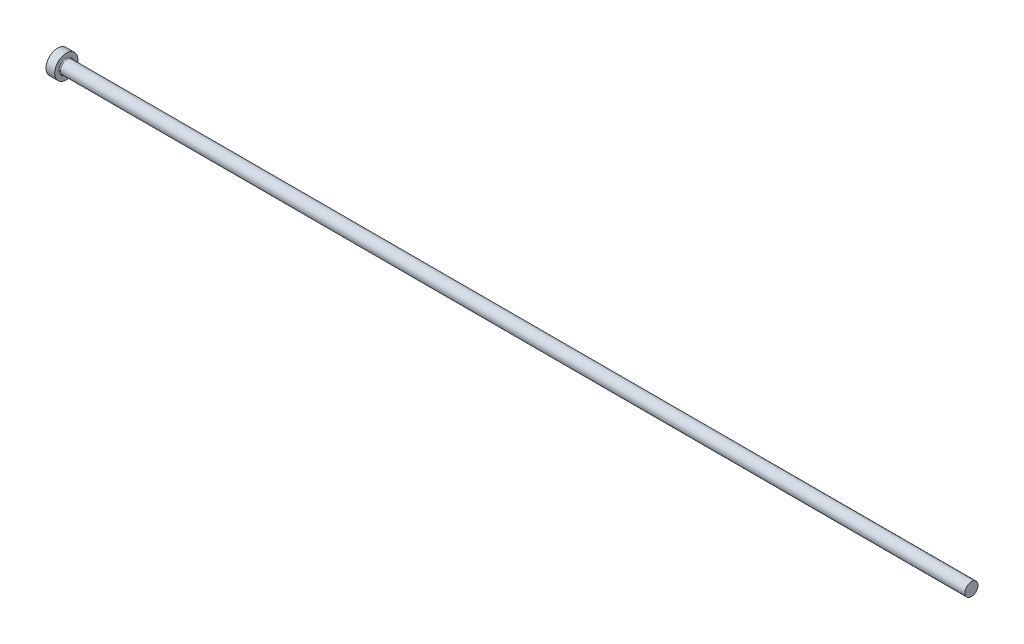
ISO-10303-21;
HEADER;
FILE_DESCRIPTION(('STEP AP214'),'2;1');
FILE_NAME('part.step','',(''),(''),'','','');
FILE_SCHEMA(('AUTOMOTIVE_DESIGN { 1 0 10303 214 1 1 1 1 }'));
ENDSEC;
DATA;
#1=APPLICATION_CONTEXT('core data for automotive mechanical design processes');
#2=APPLICATION_PROTOCOL_DEFINITION('international standard','automotive_design',2000,#1);
#3=PRODUCT_CONTEXT('',#1,'mechanical');
#4=PRODUCT('Part','Part','',(#3));
#5=PRODUCT_RELATED_PRODUCT_CATEGORY('part','',(#4));
#6=PRODUCT_DEFINITION_FORMATION('','',#4);
#7=PRODUCT_DEFINITION_CONTEXT('part definition',#1,'design');
#8=PRODUCT_DEFINITION('design','',#6,#7);
#9=PRODUCT_DEFINITION_SHAPE('','',#8);
#10=(LENGTH_UNIT() NAMED_UNIT(*) SI_UNIT(.MILLI.,.METRE.));
#11=(NAMED_UNIT(*) PLANE_ANGLE_UNIT() SI_UNIT($,.RADIAN.));
#12=(NAMED_UNIT(*) SI_UNIT($,.STERADIAN.) SOLID_ANGLE_UNIT());
#13=UNCERTAINTY_MEASURE_WITH_UNIT(LENGTH_MEASURE(1.E-05),#10,'distance_accuracy_value','');
#14=(GEOMETRIC_REPRESENTATION_CONTEXT(3) GLOBAL_UNCERTAINTY_ASSIGNED_CONTEXT((#13)) GLOBAL_UNIT_ASSIGNED_CONTEXT((#10,
#11,#12)) REPRESENTATION_CONTEXT('',''));
#15=CARTESIAN_POINT('',(0.,0.,0.));
#16=DIRECTION('',(0.,0.,1.));
#17=DIRECTION('',(1.,0.,0.));
#18=AXIS2_PLACEMENT_3D('',#15,#16,#17);
#19=CARTESIAN_POINT('',(0.,0.,0.));
#20=DIRECTION('',(-1.,0.,0.));
#21=DIRECTION('',(0.,-1.,0.));
#22=AXIS2_PLACEMENT_3D('',#19,#20,#21);
#23=PLANE('',#22);
#24=CARTESIAN_POINT('',(0.,0.,0.));
#25=DIRECTION('',(1.,0.,0.));
#26=DIRECTION('',(0.,1.,0.));
#27=AXIS2_PLACEMENT_3D('',#24,#25,#26);
#28=CIRCLE('',#27,4.);
#29=CARTESIAN_POINT('',(0.,4.,0.));
#30=VERTEX_POINT('',#29);
#31=EDGE_CURVE('E25',#30,#30,#28,.T.);
#32=ORIENTED_EDGE('',*,*,#31,.F.);
#33=EDGE_LOOP('',(#32));
#34=FACE_BOUND('',#33,.T.);
#35=ADVANCED_FACE('F14',(#34),#23,.T.);
#36=CARTESIAN_POINT('',(315.,0.,0.));
#37=DIRECTION('',(1.,0.,0.));
#38=DIRECTION('',(0.,1.,0.));
#39=AXIS2_PLACEMENT_3D('',#36,#37,#38);
#40=CYLINDRICAL_SURFACE('',#39,4.);
#41=ORIENTED_EDGE('',*,*,#31,.T.);
#42=EDGE_LOOP('',(#41));
#43=FACE_BOUND('',#42,.T.);
#44=CARTESIAN_POINT('',(3.,0.,0.));
#45=DIRECTION('',(1.,0.,0.));
#46=DIRECTION('',(0.,1.,0.));
#47=AXIS2_PLACEMENT_3D('',#44,#45,#46);
#48=CIRCLE('',#47,4.);
#49=CARTESIAN_POINT('',(3.,4.,0.));
#50=VERTEX_POINT('',#49);
#51=EDGE_CURVE('E29',#50,#50,#48,.T.);
#52=ORIENTED_EDGE('',*,*,#51,.F.);
#53=EDGE_LOOP('',(#52));
#54=FACE_BOUND('',#53,.T.);
#55=ADVANCED_FACE('F51',(#43,#54),#40,.T.);
#56=CARTESIAN_POINT('',(3.,4.,0.));
#57=DIRECTION('',(1.,0.,0.));
#58=DIRECTION('',(0.,1.,0.));
#59=AXIS2_PLACEMENT_3D('',#56,#57,#58);
#60=PLANE('',#59);
#61=CARTESIAN_POINT('',(3.,0.,0.));
#62=DIRECTION('',(1.,0.,0.));
#63=DIRECTION('',(0.,1.,0.));
#64=AXIS2_PLACEMENT_3D('',#61,#62,#63);
#65=CIRCLE('',#64,2.54999999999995);
#66=CARTESIAN_POINT('',(3.,2.54999999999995,0.));
#67=VERTEX_POINT('',#66);
#68=EDGE_CURVE('E9',#67,#67,#65,.F.);
#69=ORIENTED_EDGE('',*,*,#68,.T.);
#70=EDGE_LOOP('',(#69));
#71=FACE_BOUND('',#70,.T.);
#72=ORIENTED_EDGE('',*,*,#51,.T.);
#73=EDGE_LOOP('',(#72));
#74=FACE_BOUND('',#73,.T.);
#75=ADVANCED_FACE('F42',(#71,#74),#60,.T.);
#76=CARTESIAN_POINT('',(315.,0.,0.));
#77=DIRECTION('',(1.,0.,0.));
#78=DIRECTION('',(0.,1.,0.));
#79=AXIS2_PLACEMENT_3D('',#76,#77,#78);
#80=CYLINDRICAL_SURFACE('',#79,2.24999999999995);
#81=CARTESIAN_POINT('',(3.3,0.,0.));
#82=DIRECTION('',(1.,0.,0.));
#83=DIRECTION('',(0.,1.,0.));
#84=AXIS2_PLACEMENT_3D('',#81,#82,#83);
#85=CIRCLE('',#84,2.24999999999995);
#86=CARTESIAN_POINT('',(3.3,2.24999999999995,0.));
#87=VERTEX_POINT('',#86);
#88=EDGE_CURVE('E21',#87,#87,#85,.T.);
#89=ORIENTED_EDGE('',*,*,#88,.T.);
#90=EDGE_LOOP('',(#89));
#91=FACE_BOUND('',#90,.T.);
#92=CARTESIAN_POINT('',(315.,0.,0.));
#93=DIRECTION('',(1.,0.,0.));
#94=DIRECTION('',(0.,1.,0.));
#95=AXIS2_PLACEMENT_3D('',#92,#93,#94);
#96=CIRCLE('',#95,2.24999999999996);
#97=CARTESIAN_POINT('',(315.,2.24999999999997,0.));
#98=VERTEX_POINT('',#97);
#99=EDGE_CURVE('E34',#98,#98,#96,.T.);
#100=ORIENTED_EDGE('',*,*,#99,.F.);
#101=EDGE_LOOP('',(#100));
#102=FACE_BOUND('',#101,.T.);
#103=ADVANCED_FACE('F40',(#91,#102),#80,.T.);
#104=CARTESIAN_POINT('',(315.,2.24999999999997,0.));
#105=DIRECTION('',(1.,0.,0.));
#106=DIRECTION('',(0.,1.,0.));
#107=AXIS2_PLACEMENT_3D('',#104,#105,#106);
#108=PLANE('',#107);
#109=ORIENTED_EDGE('',*,*,#99,.T.);
#110=EDGE_LOOP('',(#109));
#111=FACE_BOUND('',#110,.T.);
#112=ADVANCED_FACE('F38',(#111),#108,.T.);
#113=CARTESIAN_POINT('',(3.3,0.,0.));
#114=DIRECTION('',(1.,0.,0.));
#115=DIRECTION('',(0.,1.,0.));
#116=AXIS2_PLACEMENT_3D('',#113,#114,#115);
#117=TOROIDAL_SURFACE('',#116,2.54999999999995,0.3);
#118=ORIENTED_EDGE('',*,*,#68,.F.);
#119=EDGE_LOOP('',(#118));
#120=FACE_BOUND('',#119,.T.);
#121=ORIENTED_EDGE('',*,*,#88,.F.);
#122=EDGE_LOOP('',(#121));
#123=FACE_BOUND('',#122,.T.);
#124=ADVANCED_FACE('F16',(#120,#123),#117,.F.);
#125=CLOSED_SHELL('',(#35,#55,#75,#103,#112,#124));
#126=MANIFOLD_SOLID_BREP('B1',#125);
#127=ADVANCED_BREP_SHAPE_REPRESENTATION('',(#18,#126),#14);
#128=SHAPE_DEFINITION_REPRESENTATION(#9,#127);
ENDSEC;
END-ISO-10303-21;
